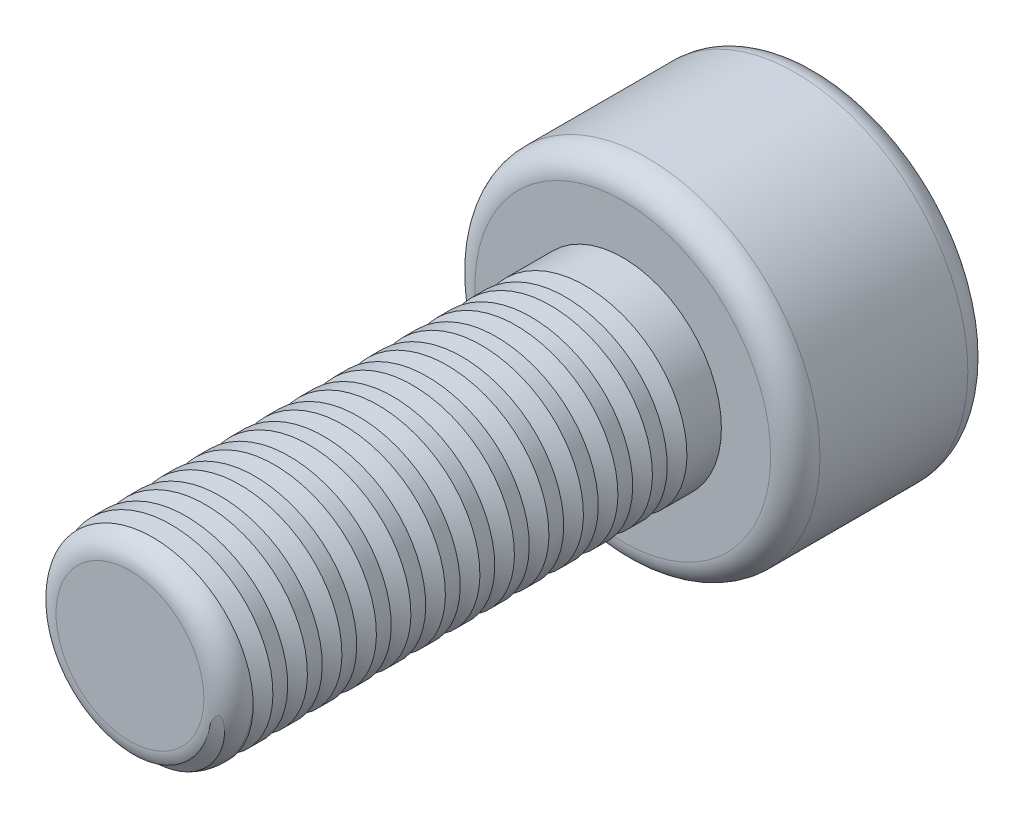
from build123d import *

# Parameters (mm, degrees)
SKETCH_1_R          = 3.5
EXTRUDE_1_DEPTH     = 4
SKETCH_2_R          = 2
EXTRUDE_2_DEPTH     = 10
FILLET_1_R          = 0.5
SWEEP_1_PITCH       = 0.7
SWEEP_1_HEIGHT      = 9.5
SWEEP_1_RADIUS      = 1.65
SWEEP_1_START_ANGLE = 90
CUT_EXTRUDE_1_DEPTH = 2
FILLET_2_R          = 0.5


with BuildPart() as part:
    # Sketch 1 → Extrude 1 (new body)
    with BuildSketch(Plane.XY):
        Circle(SKETCH_1_R)
    extrude(amount=EXTRUDE_1_DEPTH)

    # Sketch 2 → Extrude 2 (add)
    with BuildSketch(Plane.XY.offset(4)):
        Circle(SKETCH_2_R)
    extrude(amount=EXTRUDE_2_DEPTH)

    # Fillet 1
    fillet_1_edges = [part.edges().sort_by_distance(p)[0] for p in [
        (-2, 0, 14),
    ]]
    fillet(fillet_1_edges, radius=FILLET_1_R)

    # Sweep 1: sweep along a helix
    with BuildLine() as sweep_1_path:
        add(Helix(SWEEP_1_PITCH, SWEEP_1_HEIGHT, SWEEP_1_RADIUS, center=(0, 0, 14), direction=(0, 0, -1), mode=Mode.PRIVATE).rotate(Axis((0, 0, 14), (0, 0, -1)), SWEEP_1_START_ANGLE))
    # Sketch 4 → Sweep 1 (sweep, cut)
    with BuildSketch(Plane(origin=(0, 0, 0), x_dir=(1, 0, 0), z_dir=(0, 1, 0))):
        Polygon((1.654250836, -14.002725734), (2.634719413, -14.568799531), (2.634719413, -13.436651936), align=None)
    sweep(path=sweep_1_path.line, is_frenet=True, mode=Mode.SUBTRACT)

    # Sketch 5 → Cut-Extrude 1 (cut)
    with BuildSketch(Plane(origin=(0, 0, 0), x_dir=(-1, 0, 0), z_dir=(0, 0, -1))):
        Polygon((1.732050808, 0), (0.866025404, 1.5), (-0.866025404, 1.5), (-1.732050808, 0), (-0.866025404, -1.5), (0.866025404, -1.5), align=None)
    extrude(amount=-CUT_EXTRUDE_1_DEPTH, mode=Mode.SUBTRACT)

    # Fillet 2
    fillet_2_edges = [part.edges().sort_by_distance(p)[0] for p in [
        (-3.5, 0, 0),
        (-3.5, 0, 4),
    ]]
    fillet(fillet_2_edges, radius=FILLET_2_R)


solid = part.part
